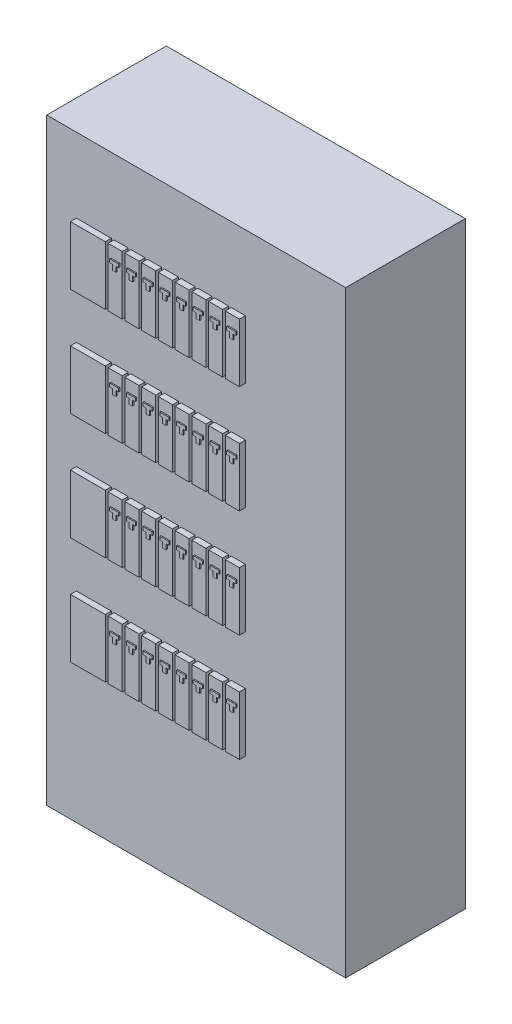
from build123d import *

# Parameters (mm, degrees)
ESQUISSE1_W        = 250
ESQUISSE1_H        = 500
BOSS_EXTRU_1_DEPTH = 100
ESQUISSE2_W        = 11.777575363
ESQUISSE2_H        = 48.987815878
ESQUISSE2_W_2      = 29.197239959
BOSS_EXTRU_2_DEPTH = 5
BOSS_EXTRU_4_DEPTH = 6


with BuildPart() as part:
    # Esquisse1 → Boss.-Extru.1 (new body)
    with BuildSketch(Plane.XY):
        with Locations((125, 250)):
            Rectangle(ESQUISSE1_W, ESQUISSE1_H)
    extrude(amount=BOSS_EXTRU_1_DEPTH)

    # Esquisse2 → Boss.-Extru.2 (add)
    with BuildSketch(Plane.XY.offset(100)):
        with Locations((76.234062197, 413.255428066)):
            Rectangle(ESQUISSE2_W, ESQUISSE2_H)
        with Locations((39.398165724, 413.255428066)):
            Rectangle(ESQUISSE2_W_2, ESQUISSE2_H)
        with Locations((62.234062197, 413.255428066)):
            Rectangle(ESQUISSE2_W, ESQUISSE2_H)
        with Locations((90.234062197, 413.255428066)):
            Rectangle(ESQUISSE2_W, ESQUISSE2_H)
        with Locations((104.234062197, 413.255428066)):
            Rectangle(ESQUISSE2_W, ESQUISSE2_H)
        with Locations((118.234062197, 413.255428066)):
            Rectangle(ESQUISSE2_W, ESQUISSE2_H)
        with Locations((132.234062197, 413.255428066)):
            Rectangle(ESQUISSE2_W, ESQUISSE2_H)
        with Locations((146.234062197, 413.255428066)):
            Rectangle(ESQUISSE2_W, ESQUISSE2_H)
        with Locations((160.234062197, 413.255428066)):
            Rectangle(ESQUISSE2_W, ESQUISSE2_H)
        with Locations((76.234062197, 323.255428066)):
            Rectangle(ESQUISSE2_W, ESQUISSE2_H)
        with Locations((39.398165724, 323.255428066)):
            Rectangle(ESQUISSE2_W_2, ESQUISSE2_H)
        with Locations((62.234062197, 323.255428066)):
            Rectangle(ESQUISSE2_W, ESQUISSE2_H)
        with Locations((90.234062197, 323.255428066)):
            Rectangle(ESQUISSE2_W, ESQUISSE2_H)
        with Locations((104.234062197, 323.255428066)):
            Rectangle(ESQUISSE2_W, ESQUISSE2_H)
        with Locations((118.234062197, 323.255428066)):
            Rectangle(ESQUISSE2_W, ESQUISSE2_H)
        with Locations((132.234062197, 323.255428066)):
            Rectangle(ESQUISSE2_W, ESQUISSE2_H)
        with Locations((146.234062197, 323.255428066)):
            Rectangle(ESQUISSE2_W, ESQUISSE2_H)
        with Locations((160.234062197, 323.255428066)):
            Rectangle(ESQUISSE2_W, ESQUISSE2_H)
        with Locations((76.234062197, 233.255428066)):
            Rectangle(ESQUISSE2_W, ESQUISSE2_H)
        with Locations((39.398165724, 233.255428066)):
            Rectangle(ESQUISSE2_W_2, ESQUISSE2_H)
        with Locations((62.234062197, 233.255428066)):
            Rectangle(ESQUISSE2_W, ESQUISSE2_H)
        with Locations((90.234062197, 233.255428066)):
            Rectangle(ESQUISSE2_W, ESQUISSE2_H)
        with Locations((104.234062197, 233.255428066)):
            Rectangle(ESQUISSE2_W, ESQUISSE2_H)
        with Locations((118.234062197, 233.255428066)):
            Rectangle(ESQUISSE2_W, ESQUISSE2_H)
        with Locations((132.234062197, 233.255428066)):
            Rectangle(ESQUISSE2_W, ESQUISSE2_H)
        with Locations((146.234062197, 233.255428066)):
            Rectangle(ESQUISSE2_W, ESQUISSE2_H)
        with Locations((160.234062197, 233.255428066)):
            Rectangle(ESQUISSE2_W, ESQUISSE2_H)
        with Locations((76.234062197, 143.255428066)):
            Rectangle(ESQUISSE2_W, ESQUISSE2_H)
        with Locations((39.398165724, 143.255428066)):
            Rectangle(ESQUISSE2_W_2, ESQUISSE2_H)
        with Locations((62.234062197, 143.255428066)):
            Rectangle(ESQUISSE2_W, ESQUISSE2_H)
        with Locations((90.234062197, 143.255428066)):
            Rectangle(ESQUISSE2_W, ESQUISSE2_H)
        with Locations((104.234062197, 143.255428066)):
            Rectangle(ESQUISSE2_W, ESQUISSE2_H)
        with Locations((118.234062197, 143.255428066)):
            Rectangle(ESQUISSE2_W, ESQUISSE2_H)
        with Locations((132.234062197, 143.255428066)):
            Rectangle(ESQUISSE2_W, ESQUISSE2_H)
        with Locations((146.234062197, 143.255428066)):
            Rectangle(ESQUISSE2_W, ESQUISSE2_H)
        with Locations((160.234062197, 143.255428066)):
            Rectangle(ESQUISSE2_W, ESQUISSE2_H)
    extrude(amount=BOSS_EXTRU_2_DEPTH)

    # Esquisse3 → Boss.-Extru.4 (add)
    with BuildSketch(Plane.XY.offset(100)):
        Polygon((63.810363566, 425.394098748), (66.082272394, 425.394098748), (66.082272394, 428.206938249), (58.509242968, 428.206938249), (58.509242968, 425.394098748), (60.997524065, 425.394098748), (60.997524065, 420.958467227), (63.810363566, 420.958467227), align=None)
        Polygon((77.810363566, 425.394098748), (80.082272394, 425.394098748), (80.082272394, 428.206938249), (72.509242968, 428.206938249), (72.509242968, 425.394098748), (74.997524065, 425.394098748), (74.997524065, 420.958467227), (77.810363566, 420.958467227), align=None)
        Polygon((91.810363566, 425.394098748), (94.082272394, 425.394098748), (94.082272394, 428.206938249), (86.509242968, 428.206938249), (86.509242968, 425.394098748), (88.997524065, 425.394098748), (88.997524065, 420.958467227), (91.810363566, 420.958467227), align=None)
        Polygon((105.810363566, 425.394098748), (108.082272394, 425.394098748), (108.082272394, 428.206938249), (100.509242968, 428.206938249), (100.509242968, 425.394098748), (102.997524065, 425.394098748), (102.997524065, 420.958467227), (105.810363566, 420.958467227), align=None)
        Polygon((119.810363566, 425.394098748), (122.082272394, 425.394098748), (122.082272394, 428.206938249), (114.509242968, 428.206938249), (114.509242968, 425.394098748), (116.997524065, 425.394098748), (116.997524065, 420.958467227), (119.810363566, 420.958467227), align=None)
        Polygon((133.810363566, 425.394098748), (136.082272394, 425.394098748), (136.082272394, 428.206938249), (128.509242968, 428.206938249), (128.509242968, 425.394098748), (130.997524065, 425.394098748), (130.997524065, 420.958467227), (133.810363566, 420.958467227), align=None)
        Polygon((147.810363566, 425.394098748), (150.082272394, 425.394098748), (150.082272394, 428.206938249), (142.509242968, 428.206938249), (142.509242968, 425.394098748), (144.997524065, 425.394098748), (144.997524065, 420.958467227), (147.810363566, 420.958467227), align=None)
        Polygon((161.810363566, 425.394098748), (164.082272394, 425.394098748), (164.082272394, 428.206938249), (156.509242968, 428.206938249), (156.509242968, 425.394098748), (158.997524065, 425.394098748), (158.997524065, 420.958467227), (161.810363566, 420.958467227), align=None)
        Polygon((77.810363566, 335.394098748), (80.082272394, 335.394098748), (80.082272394, 338.206938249), (72.509242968, 338.206938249), (72.509242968, 335.394098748), (74.997524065, 335.394098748), (74.997524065, 330.958467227), (77.810363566, 330.958467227), align=None)
        Polygon((91.810363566, 335.394098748), (94.082272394, 335.394098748), (94.082272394, 338.206938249), (86.509242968, 338.206938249), (86.509242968, 335.394098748), (88.997524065, 335.394098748), (88.997524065, 330.958467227), (91.810363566, 330.958467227), align=None)
        Polygon((105.810363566, 335.394098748), (108.082272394, 335.394098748), (108.082272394, 338.206938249), (100.509242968, 338.206938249), (100.509242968, 335.394098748), (102.997524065, 335.394098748), (102.997524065, 330.958467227), (105.810363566, 330.958467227), align=None)
        Polygon((119.810363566, 335.394098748), (122.082272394, 335.394098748), (122.082272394, 338.206938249), (114.509242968, 338.206938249), (114.509242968, 335.394098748), (116.997524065, 335.394098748), (116.997524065, 330.958467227), (119.810363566, 330.958467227), align=None)
        Polygon((133.810363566, 335.394098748), (136.082272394, 335.394098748), (136.082272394, 338.206938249), (128.509242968, 338.206938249), (128.509242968, 335.394098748), (130.997524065, 335.394098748), (130.997524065, 330.958467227), (133.810363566, 330.958467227), align=None)
        Polygon((147.810363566, 335.394098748), (150.082272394, 335.394098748), (150.082272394, 338.206938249), (142.509242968, 338.206938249), (142.509242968, 335.394098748), (144.997524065, 335.394098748), (144.997524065, 330.958467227), (147.810363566, 330.958467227), align=None)
        Polygon((161.810363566, 335.394098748), (164.082272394, 335.394098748), (164.082272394, 338.206938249), (156.509242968, 338.206938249), (156.509242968, 335.394098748), (158.997524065, 335.394098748), (158.997524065, 330.958467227), (161.810363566, 330.958467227), align=None)
        Polygon((77.810363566, 245.394098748), (80.082272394, 245.394098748), (80.082272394, 248.206938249), (72.509242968, 248.206938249), (72.509242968, 245.394098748), (74.997524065, 245.394098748), (74.997524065, 240.958467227), (77.810363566, 240.958467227), align=None)
        Polygon((91.810363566, 245.394098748), (94.082272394, 245.394098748), (94.082272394, 248.206938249), (86.509242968, 248.206938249), (86.509242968, 245.394098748), (88.997524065, 245.394098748), (88.997524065, 240.958467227), (91.810363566, 240.958467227), align=None)
        Polygon((105.810363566, 245.394098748), (108.082272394, 245.394098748), (108.082272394, 248.206938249), (100.509242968, 248.206938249), (100.509242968, 245.394098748), (102.997524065, 245.394098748), (102.997524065, 240.958467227), (105.810363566, 240.958467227), align=None)
        Polygon((119.810363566, 245.394098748), (122.082272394, 245.394098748), (122.082272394, 248.206938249), (114.509242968, 248.206938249), (114.509242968, 245.394098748), (116.997524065, 245.394098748), (116.997524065, 240.958467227), (119.810363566, 240.958467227), align=None)
        Polygon((133.810363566, 245.394098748), (136.082272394, 245.394098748), (136.082272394, 248.206938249), (128.509242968, 248.206938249), (128.509242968, 245.394098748), (130.997524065, 245.394098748), (130.997524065, 240.958467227), (133.810363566, 240.958467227), align=None)
        Polygon((147.810363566, 245.394098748), (150.082272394, 245.394098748), (150.082272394, 248.206938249), (142.509242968, 248.206938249), (142.509242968, 245.394098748), (144.997524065, 245.394098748), (144.997524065, 240.958467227), (147.810363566, 240.958467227), align=None)
        Polygon((161.810363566, 245.394098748), (164.082272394, 245.394098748), (164.082272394, 248.206938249), (156.509242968, 248.206938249), (156.509242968, 245.394098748), (158.997524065, 245.394098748), (158.997524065, 240.958467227), (161.810363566, 240.958467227), align=None)
        Polygon((77.810363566, 155.394098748), (80.082272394, 155.394098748), (80.082272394, 158.206938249), (72.509242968, 158.206938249), (72.509242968, 155.394098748), (74.997524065, 155.394098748), (74.997524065, 150.958467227), (77.810363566, 150.958467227), align=None)
        Polygon((91.810363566, 155.394098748), (94.082272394, 155.394098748), (94.082272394, 158.206938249), (86.509242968, 158.206938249), (86.509242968, 155.394098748), (88.997524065, 155.394098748), (88.997524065, 150.958467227), (91.810363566, 150.958467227), align=None)
        Polygon((105.810363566, 155.394098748), (108.082272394, 155.394098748), (108.082272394, 158.206938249), (100.509242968, 158.206938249), (100.509242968, 155.394098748), (102.997524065, 155.394098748), (102.997524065, 150.958467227), (105.810363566, 150.958467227), align=None)
        Polygon((119.810363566, 155.394098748), (122.082272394, 155.394098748), (122.082272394, 158.206938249), (114.509242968, 158.206938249), (114.509242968, 155.394098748), (116.997524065, 155.394098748), (116.997524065, 150.958467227), (119.810363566, 150.958467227), align=None)
        Polygon((133.810363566, 155.394098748), (136.082272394, 155.394098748), (136.082272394, 158.206938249), (128.509242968, 158.206938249), (128.509242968, 155.394098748), (130.997524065, 155.394098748), (130.997524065, 150.958467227), (133.810363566, 150.958467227), align=None)
        Polygon((147.810363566, 155.394098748), (150.082272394, 155.394098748), (150.082272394, 158.206938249), (142.509242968, 158.206938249), (142.509242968, 155.394098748), (144.997524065, 155.394098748), (144.997524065, 150.958467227), (147.810363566, 150.958467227), align=None)
        Polygon((161.810363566, 155.394098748), (164.082272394, 155.394098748), (164.082272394, 158.206938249), (156.509242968, 158.206938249), (156.509242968, 155.394098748), (158.997524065, 155.394098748), (158.997524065, 150.958467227), (161.810363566, 150.958467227), align=None)
        Polygon((63.810363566, 335.394098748), (66.082272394, 335.394098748), (66.082272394, 338.206938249), (58.509242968, 338.206938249), (58.509242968, 335.394098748), (60.997524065, 335.394098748), (60.997524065, 330.958467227), (63.810363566, 330.958467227), align=None)
        Polygon((63.810363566, 245.394098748), (66.082272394, 245.394098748), (66.082272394, 248.206938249), (58.509242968, 248.206938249), (58.509242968, 245.394098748), (60.997524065, 245.394098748), (60.997524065, 240.958467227), (63.810363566, 240.958467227), align=None)
        Polygon((63.810363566, 155.394098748), (66.082272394, 155.394098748), (66.082272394, 158.206938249), (58.509242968, 158.206938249), (58.509242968, 155.394098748), (60.997524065, 155.394098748), (60.997524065, 150.958467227), (63.810363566, 150.958467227), align=None)
    extrude(amount=BOSS_EXTRU_4_DEPTH)


solid = part.part
